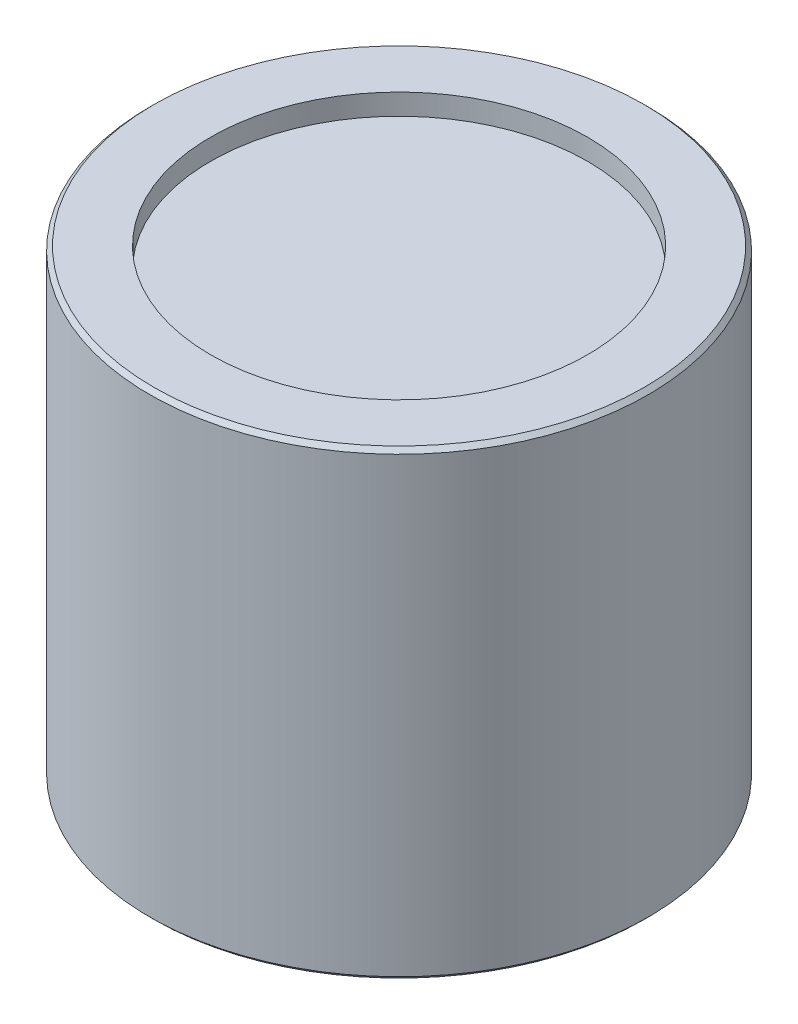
from build123d import *

# Parameters (mm, degrees)
IZIM1_W               = 45
IZIM1_H               = 7
PAH1_SIZE             = 1
IZIM2_R               = 45
KES_EKSTR_ZYON1_DEPTH = 5


with BuildPart() as part:
    # izim1 → D_nd_r1 (revolve)
    with BuildSketch(Plane(origin=(0, 0, 0), x_dir=(0, 0, -1), z_dir=(1, 0, 0)), mode=Mode.PRIVATE) as d_nd_r1_sk:
        Polygon((-45, 7), (0, 7), (0, 117), (-59.5, 117), (-59.5, 7), align=None)
        with Locations((-22.5, 3.5)):
            Rectangle(IZIM1_W, IZIM1_H)
    revolve(d_nd_r1_sk.sketch.rotate(Axis((0, 7, 0), (0, 1, 0)), 180), axis=Axis((0, 7, 0), (0, 1, 0)))

    # Pah1
    pah1_edges = [part.edges().sort_by_distance(p)[0] for p in [
        (0, 117, 59.5),
        (0, 7, 59.5),
    ]]
    chamfer(pah1_edges, length=PAH1_SIZE)

    # izim2 → Kes-Ekstr_zyon1 (cut)
    with BuildSketch(Plane(origin=(0, 117, 0), x_dir=(1, 0, 0), z_dir=(0, 1, 0))):
        with Locations(Location((0, 0, 0), (0, 0, 90))):
            Circle(IZIM2_R)
    extrude(amount=-KES_EKSTR_ZYON1_DEPTH, mode=Mode.SUBTRACT)


solid = part.part
